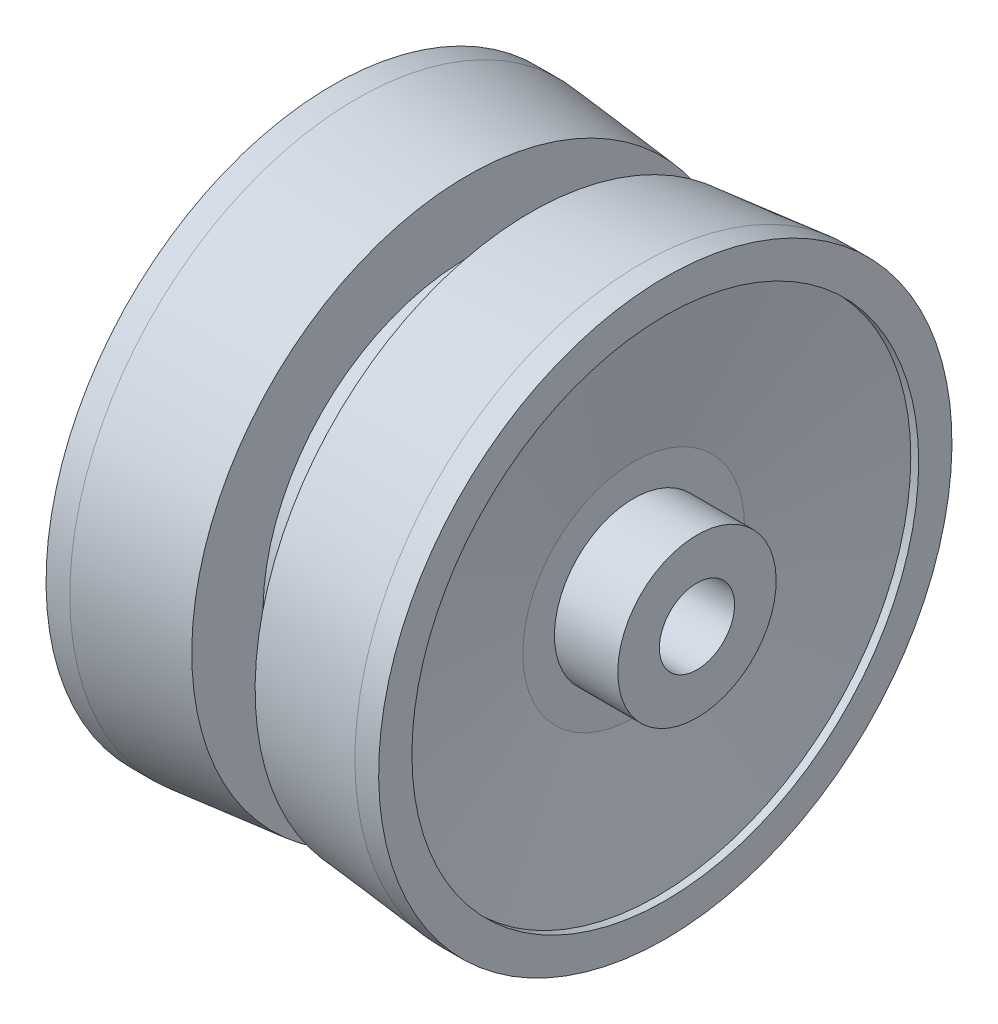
ISO-10303-21;
HEADER;
FILE_DESCRIPTION(('STEP AP214'),'2;1');
FILE_NAME('part.step','',(''),(''),'','','');
FILE_SCHEMA(('AUTOMOTIVE_DESIGN { 1 0 10303 214 1 1 1 1 }'));
ENDSEC;
DATA;
#1=APPLICATION_CONTEXT('core data for automotive mechanical design processes');
#2=APPLICATION_PROTOCOL_DEFINITION('international standard','automotive_design',2000,#1);
#3=PRODUCT_CONTEXT('',#1,'mechanical');
#4=PRODUCT('Part','Part','',(#3));
#5=PRODUCT_RELATED_PRODUCT_CATEGORY('part','',(#4));
#6=PRODUCT_DEFINITION_FORMATION('','',#4);
#7=PRODUCT_DEFINITION_CONTEXT('part definition',#1,'design');
#8=PRODUCT_DEFINITION('design','',#6,#7);
#9=PRODUCT_DEFINITION_SHAPE('','',#8);
#10=(LENGTH_UNIT() NAMED_UNIT(*) SI_UNIT(.MILLI.,.METRE.));
#11=(NAMED_UNIT(*) PLANE_ANGLE_UNIT() SI_UNIT($,.RADIAN.));
#12=(NAMED_UNIT(*) SI_UNIT($,.STERADIAN.) SOLID_ANGLE_UNIT());
#13=UNCERTAINTY_MEASURE_WITH_UNIT(LENGTH_MEASURE(1.E-05),#10,'distance_accuracy_value','');
#14=(GEOMETRIC_REPRESENTATION_CONTEXT(3) GLOBAL_UNCERTAINTY_ASSIGNED_CONTEXT((#13)) GLOBAL_UNIT_ASSIGNED_CONTEXT((#10,
#11,#12)) REPRESENTATION_CONTEXT('',''));
#15=CARTESIAN_POINT('',(0.,0.,0.));
#16=DIRECTION('',(0.,0.,1.));
#17=DIRECTION('',(1.,0.,0.));
#18=AXIS2_PLACEMENT_3D('',#15,#16,#17);
#19=CARTESIAN_POINT('',(-61.4889458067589,0.,0.));
#20=DIRECTION('',(-1.,0.,0.));
#21=DIRECTION('',(0.,-1.,0.));
#22=AXIS2_PLACEMENT_3D('',#19,#20,#21);
#23=CYLINDRICAL_SURFACE('',#22,18.1);
#24=CARTESIAN_POINT('',(-10.5,0.,0.));
#25=DIRECTION('',(-1.,0.,0.));
#26=DIRECTION('',(0.,-1.,0.));
#27=AXIS2_PLACEMENT_3D('',#24,#25,#26);
#28=CIRCLE('',#27,18.1);
#29=CARTESIAN_POINT('',(-10.5,-18.1,0.));
#30=VERTEX_POINT('',#29);
#31=EDGE_CURVE('E10',#30,#30,#28,.T.);
#32=ORIENTED_EDGE('',*,*,#31,.F.);
#33=EDGE_LOOP('',(#32));
#34=FACE_BOUND('',#33,.T.);
#35=CARTESIAN_POINT('',(-9.,0.,0.));
#36=DIRECTION('',(-1.,0.,0.));
#37=DIRECTION('',(0.,-1.,0.));
#38=AXIS2_PLACEMENT_3D('',#35,#36,#37);
#39=CIRCLE('',#38,18.1);
#40=CARTESIAN_POINT('',(-9.,-18.1,0.));
#41=VERTEX_POINT('',#40);
#42=EDGE_CURVE('E90',#41,#41,#39,.T.);
#43=ORIENTED_EDGE('',*,*,#42,.T.);
#44=EDGE_LOOP('',(#43));
#45=FACE_BOUND('',#44,.T.);
#46=ADVANCED_FACE('F32',(#34,#45),#23,.T.);
#47=CARTESIAN_POINT('',(-10.5,18.1,0.));
#48=DIRECTION('',(1.,0.,0.));
#49=DIRECTION('',(0.,1.,0.));
#50=AXIS2_PLACEMENT_3D('',#47,#48,#49);
#51=PLANE('',#50);
#52=CARTESIAN_POINT('',(-10.5,0.,0.));
#53=DIRECTION('',(-1.,0.,0.));
#54=DIRECTION('',(0.,-1.,0.));
#55=AXIS2_PLACEMENT_3D('',#52,#53,#54);
#56=CIRCLE('',#55,16.);
#57=CARTESIAN_POINT('',(-10.5,-16.,0.));
#58=VERTEX_POINT('',#57);
#59=EDGE_CURVE('E38',#58,#58,#56,.T.);
#60=ORIENTED_EDGE('',*,*,#59,.F.);
#61=EDGE_LOOP('',(#60));
#62=FACE_BOUND('',#61,.T.);
#63=ORIENTED_EDGE('',*,*,#31,.T.);
#64=EDGE_LOOP('',(#63));
#65=FACE_BOUND('',#64,.T.);
#66=ADVANCED_FACE('F129',(#62,#65),#51,.F.);
#67=CARTESIAN_POINT('',(-61.4889458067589,0.,0.));
#68=DIRECTION('',(-1.,0.,0.));
#69=DIRECTION('',(0.,-1.,0.));
#70=AXIS2_PLACEMENT_3D('',#67,#68,#69);
#71=CYLINDRICAL_SURFACE('',#70,16.);
#72=CARTESIAN_POINT('',(-10.,0.,0.));
#73=DIRECTION('',(-1.,0.,0.));
#74=DIRECTION('',(0.,-1.,0.));
#75=AXIS2_PLACEMENT_3D('',#72,#73,#74);
#76=CIRCLE('',#75,16.);
#77=CARTESIAN_POINT('',(-10.,-16.,0.));
#78=VERTEX_POINT('',#77);
#79=EDGE_CURVE('E42',#78,#78,#76,.T.);
#80=ORIENTED_EDGE('',*,*,#79,.F.);
#81=EDGE_LOOP('',(#80));
#82=FACE_BOUND('',#81,.T.);
#83=ORIENTED_EDGE('',*,*,#59,.T.);
#84=EDGE_LOOP('',(#83));
#85=FACE_BOUND('',#84,.T.);
#86=ADVANCED_FACE('F134',(#82,#85),#71,.F.);
#87=CARTESIAN_POINT('',(-10.,0.,0.));
#88=DIRECTION('',(-1.,0.,0.));
#89=DIRECTION('',(0.,-1.,0.));
#90=AXIS2_PLACEMENT_3D('',#87,#88,#89);
#91=CONICAL_SURFACE('',#90,16.,1.40564764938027);
#92=CARTESIAN_POINT('',(-8.5,0.,0.));
#93=DIRECTION('',(-1.,0.,0.));
#94=DIRECTION('',(0.,-1.,0.));
#95=AXIS2_PLACEMENT_3D('',#92,#93,#94);
#96=CIRCLE('',#95,6.99999999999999);
#97=CARTESIAN_POINT('',(-8.5,-6.99999999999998,0.));
#98=VERTEX_POINT('',#97);
#99=EDGE_CURVE('E46',#98,#98,#96,.T.);
#100=ORIENTED_EDGE('',*,*,#99,.F.);
#101=EDGE_LOOP('',(#100));
#102=FACE_BOUND('',#101,.T.);
#103=ORIENTED_EDGE('',*,*,#79,.T.);
#104=EDGE_LOOP('',(#103));
#105=FACE_BOUND('',#104,.T.);
#106=ADVANCED_FACE('F263',(#102,#105),#91,.F.);
#107=CARTESIAN_POINT('',(-8.5,7.,0.));
#108=DIRECTION('',(1.,0.,0.));
#109=DIRECTION('',(0.,1.,0.));
#110=AXIS2_PLACEMENT_3D('',#107,#108,#109);
#111=PLANE('',#110);
#112=CARTESIAN_POINT('',(-8.5,0.,0.));
#113=DIRECTION('',(-1.,0.,0.));
#114=DIRECTION('',(0.,-1.,0.));
#115=AXIS2_PLACEMENT_3D('',#112,#113,#114);
#116=CIRCLE('',#115,4.99999999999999);
#117=CARTESIAN_POINT('',(-8.5,-4.99999999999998,0.));
#118=VERTEX_POINT('',#117);
#119=EDGE_CURVE('E51',#118,#118,#116,.T.);
#120=ORIENTED_EDGE('',*,*,#119,.F.);
#121=EDGE_LOOP('',(#120));
#122=FACE_BOUND('',#121,.T.);
#123=ORIENTED_EDGE('',*,*,#99,.T.);
#124=EDGE_LOOP('',(#123));
#125=FACE_BOUND('',#124,.T.);
#126=ADVANCED_FACE('F256',(#122,#125),#111,.F.);
#127=CARTESIAN_POINT('',(-61.4889458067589,0.,0.));
#128=DIRECTION('',(-1.,0.,0.));
#129=DIRECTION('',(0.,-1.,0.));
#130=AXIS2_PLACEMENT_3D('',#127,#128,#129);
#131=CYLINDRICAL_SURFACE('',#130,4.99999999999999);
#132=CARTESIAN_POINT('',(-12.5,0.,0.));
#133=DIRECTION('',(-1.,0.,0.));
#134=DIRECTION('',(0.,-1.,0.));
#135=AXIS2_PLACEMENT_3D('',#132,#133,#134);
#136=CIRCLE('',#135,4.99999999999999);
#137=CARTESIAN_POINT('',(-12.5,-4.99999999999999,0.));
#138=VERTEX_POINT('',#137);
#139=EDGE_CURVE('E54',#138,#138,#136,.T.);
#140=ORIENTED_EDGE('',*,*,#139,.F.);
#141=EDGE_LOOP('',(#140));
#142=FACE_BOUND('',#141,.T.);
#143=ORIENTED_EDGE('',*,*,#119,.T.);
#144=EDGE_LOOP('',(#143));
#145=FACE_BOUND('',#144,.T.);
#146=ADVANCED_FACE('F246',(#142,#145),#131,.T.);
#147=CARTESIAN_POINT('',(-12.5,5.,0.));
#148=DIRECTION('',(1.,0.,0.));
#149=DIRECTION('',(0.,1.,0.));
#150=AXIS2_PLACEMENT_3D('',#147,#148,#149);
#151=PLANE('',#150);
#152=CARTESIAN_POINT('',(-12.5,0.,0.));
#153=DIRECTION('',(1.,0.,0.));
#154=DIRECTION('',(0.,1.,0.));
#155=AXIS2_PLACEMENT_3D('',#152,#153,#154);
#156=CIRCLE('',#155,2.375);
#157=CARTESIAN_POINT('',(-12.5,2.37500000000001,0.));
#158=VERTEX_POINT('',#157);
#159=EDGE_CURVE('E93',#158,#158,#156,.T.);
#160=ORIENTED_EDGE('',*,*,#159,.T.);
#161=EDGE_LOOP('',(#160));
#162=FACE_BOUND('',#161,.T.);
#163=ORIENTED_EDGE('',*,*,#139,.T.);
#164=EDGE_LOOP('',(#163));
#165=FACE_BOUND('',#164,.T.);
#166=ADVANCED_FACE('F100',(#162,#165),#151,.F.);
#167=CARTESIAN_POINT('',(12.5,0.,0.));
#168=DIRECTION('',(-1.,0.,0.));
#169=DIRECTION('',(0.,-1.,0.));
#170=AXIS2_PLACEMENT_3D('',#167,#168,#169);
#171=PLANE('',#170);
#172=CARTESIAN_POINT('',(12.5,0.,0.));
#173=DIRECTION('',(1.,0.,0.));
#174=DIRECTION('',(0.,1.,0.));
#175=AXIS2_PLACEMENT_3D('',#172,#173,#174);
#176=CIRCLE('',#175,2.375);
#177=CARTESIAN_POINT('',(12.5,2.37500000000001,0.));
#178=VERTEX_POINT('',#177);
#179=EDGE_CURVE('E94',#178,#178,#176,.T.);
#180=ORIENTED_EDGE('',*,*,#179,.F.);
#181=EDGE_LOOP('',(#180));
#182=FACE_BOUND('',#181,.T.);
#183=CARTESIAN_POINT('',(12.5,0.,0.));
#184=DIRECTION('',(-1.,0.,0.));
#185=DIRECTION('',(0.,-1.,0.));
#186=AXIS2_PLACEMENT_3D('',#183,#184,#185);
#187=CIRCLE('',#186,4.99999999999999);
#188=CARTESIAN_POINT('',(12.5,-4.99999999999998,0.));
#189=VERTEX_POINT('',#188);
#190=EDGE_CURVE('E57',#189,#189,#187,.T.);
#191=ORIENTED_EDGE('',*,*,#190,.F.);
#192=EDGE_LOOP('',(#191));
#193=FACE_BOUND('',#192,.T.);
#194=ADVANCED_FACE('F110',(#182,#193),#171,.F.);
#195=CARTESIAN_POINT('',(-61.4889458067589,0.,0.));
#196=DIRECTION('',(-1.,0.,0.));
#197=DIRECTION('',(0.,-1.,0.));
#198=AXIS2_PLACEMENT_3D('',#195,#196,#197);
#199=CYLINDRICAL_SURFACE('',#198,4.99999999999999);
#200=CARTESIAN_POINT('',(8.50000000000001,0.,0.));
#201=DIRECTION('',(-1.,0.,0.));
#202=DIRECTION('',(0.,-1.,0.));
#203=AXIS2_PLACEMENT_3D('',#200,#201,#202);
#204=CIRCLE('',#203,4.99999999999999);
#205=CARTESIAN_POINT('',(8.50000000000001,-4.99999999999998,0.));
#206=VERTEX_POINT('',#205);
#207=EDGE_CURVE('E60',#206,#206,#204,.T.);
#208=ORIENTED_EDGE('',*,*,#207,.F.);
#209=EDGE_LOOP('',(#208));
#210=FACE_BOUND('',#209,.T.);
#211=ORIENTED_EDGE('',*,*,#190,.T.);
#212=EDGE_LOOP('',(#211));
#213=FACE_BOUND('',#212,.T.);
#214=ADVANCED_FACE('F113',(#210,#213),#199,.T.);
#215=CARTESIAN_POINT('',(8.5,5.,0.));
#216=DIRECTION('',(-1.,0.,0.));
#217=DIRECTION('',(0.,-1.,0.));
#218=AXIS2_PLACEMENT_3D('',#215,#216,#217);
#219=PLANE('',#218);
#220=CARTESIAN_POINT('',(8.50000000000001,0.,0.));
#221=DIRECTION('',(-1.,0.,0.));
#222=DIRECTION('',(0.,-1.,0.));
#223=AXIS2_PLACEMENT_3D('',#220,#221,#222);
#224=CIRCLE('',#223,6.99999999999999);
#225=CARTESIAN_POINT('',(8.50000000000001,-6.99999999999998,0.));
#226=VERTEX_POINT('',#225);
#227=EDGE_CURVE('E63',#226,#226,#224,.T.);
#228=ORIENTED_EDGE('',*,*,#227,.F.);
#229=EDGE_LOOP('',(#228));
#230=FACE_BOUND('',#229,.T.);
#231=ORIENTED_EDGE('',*,*,#207,.T.);
#232=EDGE_LOOP('',(#231));
#233=FACE_BOUND('',#232,.T.);
#234=ADVANCED_FACE('F118',(#230,#233),#219,.F.);
#235=CARTESIAN_POINT('',(8.50000000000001,0.,0.));
#236=DIRECTION('',(1.,0.,0.));
#237=DIRECTION('',(0.,1.,0.));
#238=AXIS2_PLACEMENT_3D('',#235,#236,#237);
#239=CONICAL_SURFACE('',#238,6.99999999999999,1.40564764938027);
#240=CARTESIAN_POINT('',(9.99999999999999,0.,0.));
#241=DIRECTION('',(-1.,0.,0.));
#242=DIRECTION('',(0.,-1.,0.));
#243=AXIS2_PLACEMENT_3D('',#240,#241,#242);
#244=CIRCLE('',#243,16.);
#245=CARTESIAN_POINT('',(10.,-16.,0.));
#246=VERTEX_POINT('',#245);
#247=EDGE_CURVE('E66',#246,#246,#244,.T.);
#248=ORIENTED_EDGE('',*,*,#247,.F.);
#249=EDGE_LOOP('',(#248));
#250=FACE_BOUND('',#249,.T.);
#251=ORIENTED_EDGE('',*,*,#227,.T.);
#252=EDGE_LOOP('',(#251));
#253=FACE_BOUND('',#252,.T.);
#254=ADVANCED_FACE('F124',(#250,#253),#239,.F.);
#255=CARTESIAN_POINT('',(-61.4889458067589,0.,0.));
#256=DIRECTION('',(-1.,0.,0.));
#257=DIRECTION('',(0.,-1.,0.));
#258=AXIS2_PLACEMENT_3D('',#255,#256,#257);
#259=CYLINDRICAL_SURFACE('',#258,16.);
#260=CARTESIAN_POINT('',(10.5,0.,0.));
#261=DIRECTION('',(-1.,0.,0.));
#262=DIRECTION('',(0.,-1.,0.));
#263=AXIS2_PLACEMENT_3D('',#260,#261,#262);
#264=CIRCLE('',#263,16.);
#265=CARTESIAN_POINT('',(10.5,-16.,0.));
#266=VERTEX_POINT('',#265);
#267=EDGE_CURVE('E69',#266,#266,#264,.T.);
#268=ORIENTED_EDGE('',*,*,#267,.F.);
#269=EDGE_LOOP('',(#268));
#270=FACE_BOUND('',#269,.T.);
#271=ORIENTED_EDGE('',*,*,#247,.T.);
#272=EDGE_LOOP('',(#271));
#273=FACE_BOUND('',#272,.T.);
#274=ADVANCED_FACE('F177',(#270,#273),#259,.F.);
#275=CARTESIAN_POINT('',(10.5,16.,0.));
#276=DIRECTION('',(-1.,0.,0.));
#277=DIRECTION('',(0.,-1.,0.));
#278=AXIS2_PLACEMENT_3D('',#275,#276,#277);
#279=PLANE('',#278);
#280=CARTESIAN_POINT('',(10.5,0.,0.));
#281=DIRECTION('',(-1.,0.,0.));
#282=DIRECTION('',(0.,-1.,0.));
#283=AXIS2_PLACEMENT_3D('',#280,#281,#282);
#284=CIRCLE('',#283,18.1);
#285=CARTESIAN_POINT('',(10.5,-18.1,0.));
#286=VERTEX_POINT('',#285);
#287=EDGE_CURVE('E72',#286,#286,#284,.T.);
#288=ORIENTED_EDGE('',*,*,#287,.F.);
#289=EDGE_LOOP('',(#288));
#290=FACE_BOUND('',#289,.T.);
#291=ORIENTED_EDGE('',*,*,#267,.T.);
#292=EDGE_LOOP('',(#291));
#293=FACE_BOUND('',#292,.T.);
#294=ADVANCED_FACE('F171',(#290,#293),#279,.F.);
#295=CARTESIAN_POINT('',(-61.4889458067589,0.,0.));
#296=DIRECTION('',(-1.,0.,0.));
#297=DIRECTION('',(0.,-1.,0.));
#298=AXIS2_PLACEMENT_3D('',#295,#296,#297);
#299=CYLINDRICAL_SURFACE('',#298,18.1);
#300=CARTESIAN_POINT('',(8.99999999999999,0.,0.));
#301=DIRECTION('',(-1.,0.,0.));
#302=DIRECTION('',(0.,-1.,0.));
#303=AXIS2_PLACEMENT_3D('',#300,#301,#302);
#304=CIRCLE('',#303,18.1);
#305=CARTESIAN_POINT('',(9.,-18.1,0.));
#306=VERTEX_POINT('',#305);
#307=EDGE_CURVE('E75',#306,#306,#304,.T.);
#308=ORIENTED_EDGE('',*,*,#307,.F.);
#309=EDGE_LOOP('',(#308));
#310=FACE_BOUND('',#309,.T.);
#311=ORIENTED_EDGE('',*,*,#287,.T.);
#312=EDGE_LOOP('',(#311));
#313=FACE_BOUND('',#312,.T.);
#314=ADVANCED_FACE('F165',(#310,#313),#299,.T.);
#315=CARTESIAN_POINT('',(8.99999999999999,0.,0.));
#316=DIRECTION('',(1.,0.,0.));
#317=DIRECTION('',(0.,1.,0.));
#318=AXIS2_PLACEMENT_3D('',#315,#316,#317);
#319=CONICAL_SURFACE('',#318,18.1,0.099668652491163);
#320=CARTESIAN_POINT('',(2.,0.,0.));
#321=DIRECTION('',(-1.,0.,0.));
#322=DIRECTION('',(0.,-1.,0.));
#323=AXIS2_PLACEMENT_3D('',#320,#321,#322);
#324=CIRCLE('',#323,17.4);
#325=CARTESIAN_POINT('',(2.,-17.4,0.));
#326=VERTEX_POINT('',#325);
#327=EDGE_CURVE('E78',#326,#326,#324,.T.);
#328=ORIENTED_EDGE('',*,*,#327,.F.);
#329=EDGE_LOOP('',(#328));
#330=FACE_BOUND('',#329,.T.);
#331=ORIENTED_EDGE('',*,*,#307,.T.);
#332=EDGE_LOOP('',(#331));
#333=FACE_BOUND('',#332,.T.);
#334=ADVANCED_FACE('F159',(#330,#333),#319,.T.);
#335=CARTESIAN_POINT('',(2.,17.4,0.));
#336=DIRECTION('',(1.,0.,0.));
#337=DIRECTION('',(0.,1.,0.));
#338=AXIS2_PLACEMENT_3D('',#335,#336,#337);
#339=PLANE('',#338);
#340=CARTESIAN_POINT('',(2.,0.,0.));
#341=DIRECTION('',(-1.,0.,0.));
#342=DIRECTION('',(0.,-1.,0.));
#343=AXIS2_PLACEMENT_3D('',#340,#341,#342);
#344=CIRCLE('',#343,12.9);
#345=CARTESIAN_POINT('',(2.,-12.9,0.));
#346=VERTEX_POINT('',#345);
#347=EDGE_CURVE('E81',#346,#346,#344,.T.);
#348=ORIENTED_EDGE('',*,*,#347,.F.);
#349=EDGE_LOOP('',(#348));
#350=FACE_BOUND('',#349,.T.);
#351=ORIENTED_EDGE('',*,*,#327,.T.);
#352=EDGE_LOOP('',(#351));
#353=FACE_BOUND('',#352,.T.);
#354=ADVANCED_FACE('F153',(#350,#353),#339,.F.);
#355=CARTESIAN_POINT('',(-61.4889458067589,0.,0.));
#356=DIRECTION('',(-1.,0.,0.));
#357=DIRECTION('',(0.,-1.,0.));
#358=AXIS2_PLACEMENT_3D('',#355,#356,#357);
#359=CYLINDRICAL_SURFACE('',#358,12.9);
#360=CARTESIAN_POINT('',(-2.,0.,0.));
#361=DIRECTION('',(-1.,0.,0.));
#362=DIRECTION('',(0.,-1.,0.));
#363=AXIS2_PLACEMENT_3D('',#360,#361,#362);
#364=CIRCLE('',#363,12.9);
#365=CARTESIAN_POINT('',(-2.,-12.9,0.));
#366=VERTEX_POINT('',#365);
#367=EDGE_CURVE('E84',#366,#366,#364,.T.);
#368=ORIENTED_EDGE('',*,*,#367,.F.);
#369=EDGE_LOOP('',(#368));
#370=FACE_BOUND('',#369,.T.);
#371=ORIENTED_EDGE('',*,*,#347,.T.);
#372=EDGE_LOOP('',(#371));
#373=FACE_BOUND('',#372,.T.);
#374=ADVANCED_FACE('F147',(#370,#373),#359,.T.);
#375=CARTESIAN_POINT('',(-2.,12.9,0.));
#376=DIRECTION('',(-1.,0.,0.));
#377=DIRECTION('',(0.,-1.,0.));
#378=AXIS2_PLACEMENT_3D('',#375,#376,#377);
#379=PLANE('',#378);
#380=CARTESIAN_POINT('',(-2.,0.,0.));
#381=DIRECTION('',(-1.,0.,0.));
#382=DIRECTION('',(0.,-1.,0.));
#383=AXIS2_PLACEMENT_3D('',#380,#381,#382);
#384=CIRCLE('',#383,17.4);
#385=CARTESIAN_POINT('',(-2.,-17.4,0.));
#386=VERTEX_POINT('',#385);
#387=EDGE_CURVE('E87',#386,#386,#384,.T.);
#388=ORIENTED_EDGE('',*,*,#387,.F.);
#389=EDGE_LOOP('',(#388));
#390=FACE_BOUND('',#389,.T.);
#391=ORIENTED_EDGE('',*,*,#367,.T.);
#392=EDGE_LOOP('',(#391));
#393=FACE_BOUND('',#392,.T.);
#394=ADVANCED_FACE('F141',(#390,#393),#379,.F.);
#395=CARTESIAN_POINT('',(-2.,0.,0.));
#396=DIRECTION('',(-1.,0.,0.));
#397=DIRECTION('',(0.,-1.,0.));
#398=AXIS2_PLACEMENT_3D('',#395,#396,#397);
#399=CONICAL_SURFACE('',#398,17.4,0.0996686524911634);
#400=ORIENTED_EDGE('',*,*,#42,.F.);
#401=EDGE_LOOP('',(#400));
#402=FACE_BOUND('',#401,.T.);
#403=ORIENTED_EDGE('',*,*,#387,.T.);
#404=EDGE_LOOP('',(#403));
#405=FACE_BOUND('',#404,.T.);
#406=ADVANCED_FACE('F106',(#402,#405),#399,.T.);
#407=CARTESIAN_POINT('',(-12.5,0.,0.));
#408=DIRECTION('',(1.,0.,0.));
#409=DIRECTION('',(0.,1.,0.));
#410=AXIS2_PLACEMENT_3D('',#407,#408,#409);
#411=CYLINDRICAL_SURFACE('',#410,2.375);
#412=ORIENTED_EDGE('',*,*,#159,.F.);
#413=EDGE_LOOP('',(#412));
#414=FACE_BOUND('',#413,.T.);
#415=ORIENTED_EDGE('',*,*,#179,.T.);
#416=EDGE_LOOP('',(#415));
#417=FACE_BOUND('',#416,.T.);
#418=ADVANCED_FACE('F103',(#414,#417),#411,.F.);
#419=CLOSED_SHELL('',(#46,#66,#86,#106,#126,#146,#166,#194,#214,#234,#254,#274,#294,#314,#334,
#354,#374,#394,#406,#418));
#420=MANIFOLD_SOLID_BREP('B2',#419);
#421=ADVANCED_BREP_SHAPE_REPRESENTATION('',(#18,#420),#14);
#422=SHAPE_DEFINITION_REPRESENTATION(#9,#421);
ENDSEC;
END-ISO-10303-21;
